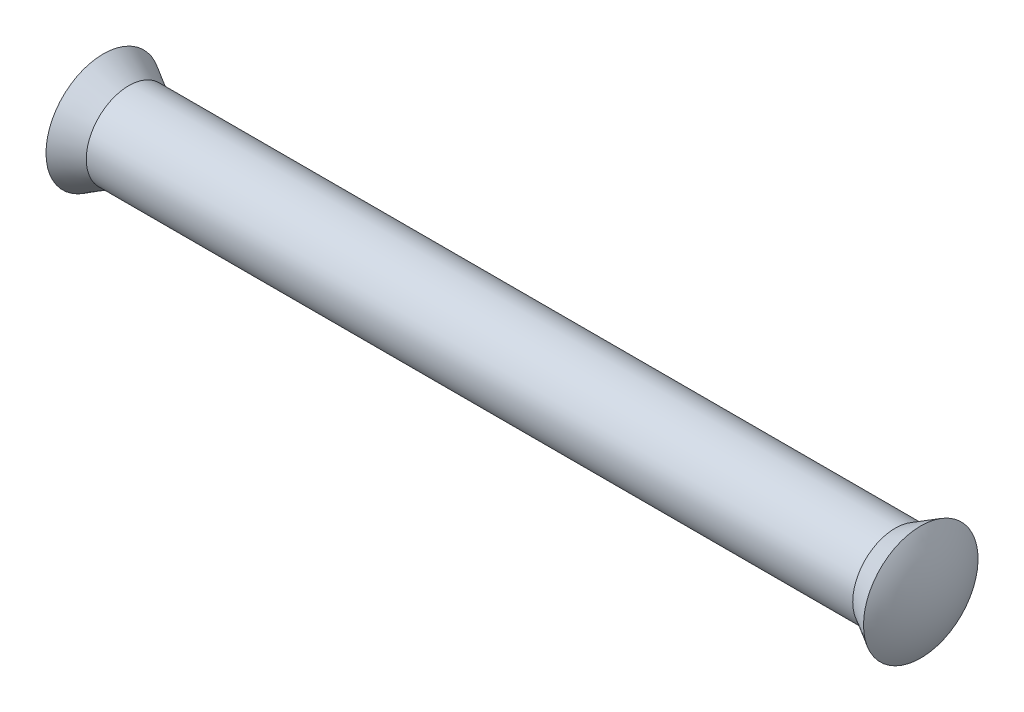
ISO-10303-21;
HEADER;
FILE_DESCRIPTION(('STEP AP214'),'2;1');
FILE_NAME('part.step','',(''),(''),'','','');
FILE_SCHEMA(('AUTOMOTIVE_DESIGN { 1 0 10303 214 1 1 1 1 }'));
ENDSEC;
DATA;
#1=APPLICATION_CONTEXT('core data for automotive mechanical design processes');
#2=APPLICATION_PROTOCOL_DEFINITION('international standard','automotive_design',2000,#1);
#3=PRODUCT_CONTEXT('',#1,'mechanical');
#4=PRODUCT('Part','Part','',(#3));
#5=PRODUCT_RELATED_PRODUCT_CATEGORY('part','',(#4));
#6=PRODUCT_DEFINITION_FORMATION('','',#4);
#7=PRODUCT_DEFINITION_CONTEXT('part definition',#1,'design');
#8=PRODUCT_DEFINITION('design','',#6,#7);
#9=PRODUCT_DEFINITION_SHAPE('','',#8);
#10=(LENGTH_UNIT() NAMED_UNIT(*) SI_UNIT(.MILLI.,.METRE.));
#11=(NAMED_UNIT(*) PLANE_ANGLE_UNIT() SI_UNIT($,.RADIAN.));
#12=(NAMED_UNIT(*) SI_UNIT($,.STERADIAN.) SOLID_ANGLE_UNIT());
#13=UNCERTAINTY_MEASURE_WITH_UNIT(LENGTH_MEASURE(1.E-05),#10,'distance_accuracy_value','');
#14=(GEOMETRIC_REPRESENTATION_CONTEXT(3) GLOBAL_UNCERTAINTY_ASSIGNED_CONTEXT((#13)) GLOBAL_UNIT_ASSIGNED_CONTEXT((#10,
#11,#12)) REPRESENTATION_CONTEXT('',''));
#15=CARTESIAN_POINT('',(0.,0.,0.));
#16=DIRECTION('',(0.,0.,1.));
#17=DIRECTION('',(1.,0.,0.));
#18=AXIS2_PLACEMENT_3D('',#15,#16,#17);
#19=CARTESIAN_POINT('',(6.35,0.,0.));
#20=DIRECTION('',(-1.,0.,0.));
#21=DIRECTION('',(0.,1.,0.));
#22=AXIS2_PLACEMENT_3D('',#19,#20,#21);
#23=SPHERICAL_SURFACE('',#22,6.35);
#24=CARTESIAN_POINT('',(0.999588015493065,0.,0.));
#25=DIRECTION('',(-1.,0.,0.));
#26=DIRECTION('',(0.,0.,1.));
#27=AXIS2_PLACEMENT_3D('',#24,#25,#26);
#28=CIRCLE('',#27,3.41988181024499);
#29=CARTESIAN_POINT('',(0.999588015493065,0.,3.41988181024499));
#30=VERTEX_POINT('',#29);
#31=EDGE_CURVE('E10',#30,#30,#28,.T.);
#32=ORIENTED_EDGE('',*,*,#31,.T.);
#33=EDGE_LOOP('',(#32));
#34=FACE_BOUND('',#33,.T.);
#35=ADVANCED_FACE('F35',(#34),#23,.T.);
#36=CARTESIAN_POINT('',(2.52358801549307,0.,0.));
#37=DIRECTION('',(-1.,0.,0.));
#38=DIRECTION('',(0.,0.,1.));
#39=AXIS2_PLACEMENT_3D('',#36,#37,#38);
#40=CONICAL_SURFACE('',#39,2.54,0.5235987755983);
#41=ORIENTED_EDGE('',*,*,#31,.F.);
#42=EDGE_LOOP('',(#41));
#43=FACE_BOUND('',#42,.T.);
#44=CARTESIAN_POINT('',(2.52358801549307,0.,0.));
#45=DIRECTION('',(-1.,0.,0.));
#46=DIRECTION('',(0.,0.,1.));
#47=AXIS2_PLACEMENT_3D('',#44,#45,#46);
#48=CIRCLE('',#47,2.54);
#49=CARTESIAN_POINT('',(2.52358801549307,0.,2.54));
#50=VERTEX_POINT('',#49);
#51=EDGE_CURVE('E41',#50,#50,#48,.T.);
#52=ORIENTED_EDGE('',*,*,#51,.T.);
#53=EDGE_LOOP('',(#52));
#54=FACE_BOUND('',#53,.T.);
#55=ADVANCED_FACE('F67',(#43,#54),#40,.T.);
#56=CARTESIAN_POINT('',(0.,0.,0.));
#57=DIRECTION('',(-1.,0.,0.));
#58=DIRECTION('',(0.,0.,1.));
#59=AXIS2_PLACEMENT_3D('',#56,#57,#58);
#60=CYLINDRICAL_SURFACE('',#59,2.54);
#61=ORIENTED_EDGE('',*,*,#51,.F.);
#62=EDGE_LOOP('',(#61));
#63=FACE_BOUND('',#62,.T.);
#64=CARTESIAN_POINT('',(48.2943880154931,0.,0.));
#65=DIRECTION('',(-1.,0.,0.));
#66=DIRECTION('',(0.,0.,1.));
#67=AXIS2_PLACEMENT_3D('',#64,#65,#66);
#68=CIRCLE('',#67,2.54);
#69=CARTESIAN_POINT('',(48.2943880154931,0.,2.54));
#70=VERTEX_POINT('',#69);
#71=EDGE_CURVE('E45',#70,#70,#68,.T.);
#72=ORIENTED_EDGE('',*,*,#71,.T.);
#73=EDGE_LOOP('',(#72));
#74=FACE_BOUND('',#73,.T.);
#75=ADVANCED_FACE('F63',(#63,#74),#60,.T.);
#76=CARTESIAN_POINT('',(49.8183880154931,0.,0.));
#77=DIRECTION('',(1.,0.,0.));
#78=DIRECTION('',(0.,0.,-1.));
#79=AXIS2_PLACEMENT_3D('',#76,#77,#78);
#80=CONICAL_SURFACE('',#79,3.41988181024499,0.523598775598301);
#81=ORIENTED_EDGE('',*,*,#71,.F.);
#82=EDGE_LOOP('',(#81));
#83=FACE_BOUND('',#82,.T.);
#84=CARTESIAN_POINT('',(49.8183880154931,0.,0.));
#85=DIRECTION('',(-1.,0.,0.));
#86=DIRECTION('',(0.,0.,1.));
#87=AXIS2_PLACEMENT_3D('',#84,#85,#86);
#88=CIRCLE('',#87,3.41988181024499);
#89=CARTESIAN_POINT('',(49.8183880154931,0.,3.41988181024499));
#90=VERTEX_POINT('',#89);
#91=EDGE_CURVE('E49',#90,#90,#88,.T.);
#92=ORIENTED_EDGE('',*,*,#91,.T.);
#93=EDGE_LOOP('',(#92));
#94=FACE_BOUND('',#93,.T.);
#95=ADVANCED_FACE('F55',(#83,#94),#80,.T.);
#96=CARTESIAN_POINT('',(44.4679760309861,0.,0.));
#97=DIRECTION('',(-1.,0.,0.));
#98=DIRECTION('',(0.,1.,0.));
#99=AXIS2_PLACEMENT_3D('',#96,#97,#98);
#100=SPHERICAL_SURFACE('',#99,6.35);
#101=ORIENTED_EDGE('',*,*,#91,.F.);
#102=EDGE_LOOP('',(#101));
#103=FACE_BOUND('',#102,.T.);
#104=ADVANCED_FACE('F57',(#103),#100,.T.);
#105=CLOSED_SHELL('',(#35,#55,#75,#95,#104));
#106=MANIFOLD_SOLID_BREP('B2',#105);
#107=ADVANCED_BREP_SHAPE_REPRESENTATION('',(#18,#106),#14);
#108=SHAPE_DEFINITION_REPRESENTATION(#9,#107);
ENDSEC;
END-ISO-10303-21;
